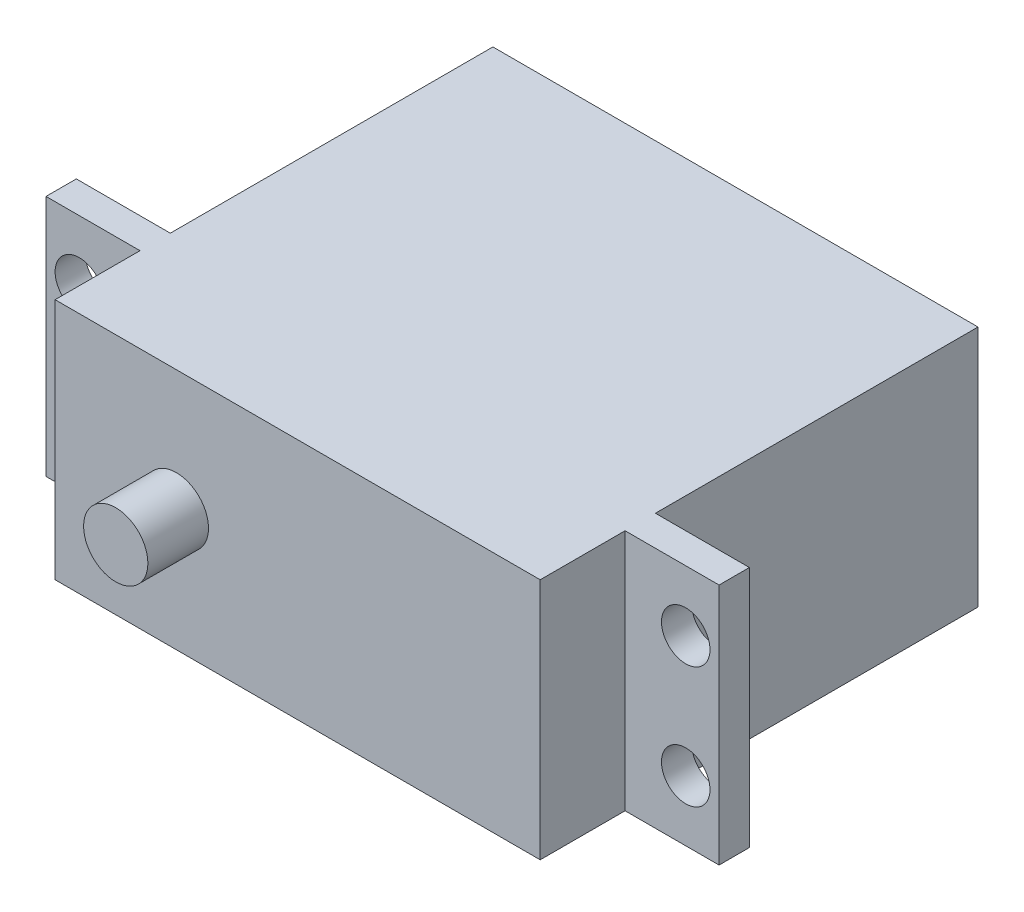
from build123d import *

# Parameters (mm, degrees)
ESQUISSE1_W             = 40
ESQUISSE1_H             = 20
BOSS_EXTRU_1_DEPTH      = 36.1
BOSS_EXTRU_2_DEPTH      = 7.75
BOSS_EXTRU_2_DEPTH_BACK = 47.75
ESQUISSE2_W             = 2.5
ESQUISSE2_H             = 20
ESQUISSE3_R             = 2
ENL_V_MAT_EXTRU_1_DEPTH = 7.5
ESQUISSE4_R             = 2
ENL_V_MAT_EXTRU_2_DEPTH = 7.5
ESQUISSE5_R             = 2.65
BOSS_EXTRU_3_DEPTH      = 5


with BuildPart() as part:
    # Esquisse1 → Boss.-Extru.1 (new body)
    with BuildSketch(Plane.XY):
        with Locations((20, 10)):
            Rectangle(ESQUISSE1_W, ESQUISSE1_H)
    extrude(amount=BOSS_EXTRU_1_DEPTH)

    # Esquisse2 → Boss.-Extru.2 (add, two sides: drawn at the far end of the back side and taken through both)
    with BuildSketch(Plane(origin=(40, 0, 0), x_dir=(0, 0, -1), z_dir=(1, 0, 0)).offset(-BOSS_EXTRU_2_DEPTH_BACK)):
        with Locations((-27.85, 10)):
            Rectangle(ESQUISSE2_W, ESQUISSE2_H)
    extrude(amount=BOSS_EXTRU_2_DEPTH + BOSS_EXTRU_2_DEPTH_BACK)

    # Esquisse3 → Enl_v. mat.-Extru.1 (cut)
    with BuildSketch(Plane.XY.offset(29.1)):
        with Locations((45, 15)):
            Circle(ESQUISSE3_R)
        with Locations((45, 5)):
            Circle(ESQUISSE3_R)
    extrude(amount=-ENL_V_MAT_EXTRU_1_DEPTH, mode=Mode.SUBTRACT)

    # Esquisse4 → Enl_v. mat.-Extru.2 (cut)
    with BuildSketch(Plane.XY.offset(29.1)):
        with Locations((-5, 15)):
            Circle(ESQUISSE4_R)
        with Locations((-5, 5)):
            Circle(ESQUISSE4_R)
    extrude(amount=-ENL_V_MAT_EXTRU_2_DEPTH, mode=Mode.SUBTRACT)

    # Esquisse5 → Boss.-Extru.3 (add)
    with BuildSketch(Plane.XY.offset(36.1)):
        with Locations(Location((10, 10, 0), (0, 0, 180))):
            Circle(ESQUISSE5_R)
    extrude(amount=BOSS_EXTRU_3_DEPTH)


solid = part.part
